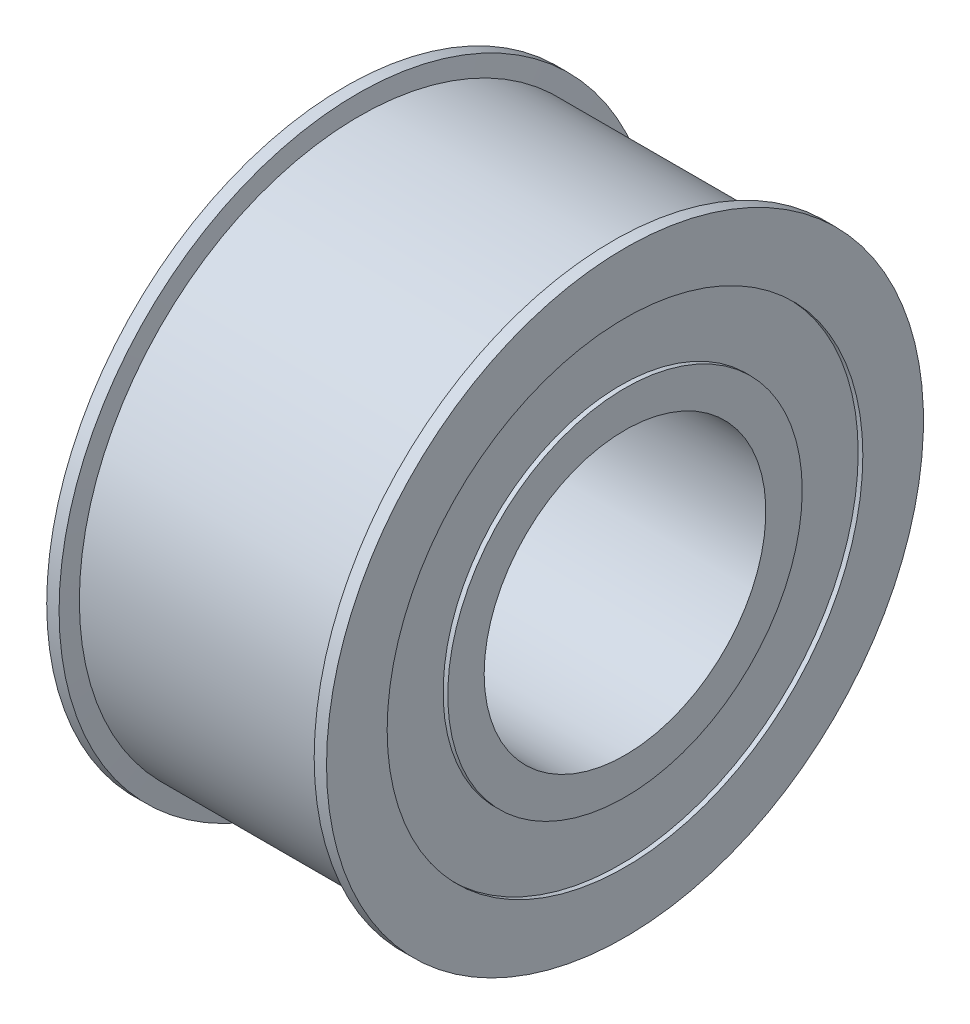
ISO-10303-21;
HEADER;
FILE_DESCRIPTION(('STEP AP214'),'2;1');
FILE_NAME('part.step','',(''),(''),'','','');
FILE_SCHEMA(('AUTOMOTIVE_DESIGN { 1 0 10303 214 1 1 1 1 }'));
ENDSEC;
DATA;
#1=APPLICATION_CONTEXT('core data for automotive mechanical design processes');
#2=APPLICATION_PROTOCOL_DEFINITION('international standard','automotive_design',2000,#1);
#3=PRODUCT_CONTEXT('',#1,'mechanical');
#4=PRODUCT('Part','Part','',(#3));
#5=PRODUCT_RELATED_PRODUCT_CATEGORY('part','',(#4));
#6=PRODUCT_DEFINITION_FORMATION('','',#4);
#7=PRODUCT_DEFINITION_CONTEXT('part definition',#1,'design');
#8=PRODUCT_DEFINITION('design','',#6,#7);
#9=PRODUCT_DEFINITION_SHAPE('','',#8);
#10=(LENGTH_UNIT() NAMED_UNIT(*) SI_UNIT(.MILLI.,.METRE.));
#11=(NAMED_UNIT(*) PLANE_ANGLE_UNIT() SI_UNIT($,.RADIAN.));
#12=(NAMED_UNIT(*) SI_UNIT($,.STERADIAN.) SOLID_ANGLE_UNIT());
#13=UNCERTAINTY_MEASURE_WITH_UNIT(LENGTH_MEASURE(1.E-05),#10,'distance_accuracy_value','');
#14=(GEOMETRIC_REPRESENTATION_CONTEXT(3) GLOBAL_UNCERTAINTY_ASSIGNED_CONTEXT((#13)) GLOBAL_UNIT_ASSIGNED_CONTEXT((#10,
#11,#12)) REPRESENTATION_CONTEXT('',''));
#15=CARTESIAN_POINT('',(0.,0.,0.));
#16=DIRECTION('',(0.,0.,1.));
#17=DIRECTION('',(1.,0.,0.));
#18=AXIS2_PLACEMENT_3D('',#15,#16,#17);
#19=CARTESIAN_POINT('',(-15.,15.1,0.));
#20=DIRECTION('',(1.,0.,0.));
#21=DIRECTION('',(0.,0.,-1.));
#22=AXIS2_PLACEMENT_3D('',#19,#20,#21);
#23=PLANE('',#22);
#24=CARTESIAN_POINT('',(-15.,0.,0.));
#25=DIRECTION('',(-1.,0.,0.));
#26=DIRECTION('',(0.,0.,1.));
#27=AXIS2_PLACEMENT_3D('',#24,#25,#26);
#28=CIRCLE('',#27,15.1);
#29=CARTESIAN_POINT('',(-15.,0.,15.1));
#30=VERTEX_POINT('',#29);
#31=EDGE_CURVE('E55',#30,#30,#28,.T.);
#32=ORIENTED_EDGE('',*,*,#31,.F.);
#33=EDGE_LOOP('',(#32));
#34=FACE_BOUND('',#33,.T.);
#35=CARTESIAN_POINT('',(-15.,0.,0.));
#36=DIRECTION('',(-1.,0.,0.));
#37=DIRECTION('',(0.,0.,1.));
#38=AXIS2_PLACEMENT_3D('',#35,#36,#37);
#39=CIRCLE('',#38,19.);
#40=CARTESIAN_POINT('',(-15.,0.,19.));
#41=VERTEX_POINT('',#40);
#42=EDGE_CURVE('E83',#41,#41,#39,.T.);
#43=ORIENTED_EDGE('',*,*,#42,.T.);
#44=EDGE_LOOP('',(#43));
#45=FACE_BOUND('',#44,.T.);
#46=ADVANCED_FACE('F32',(#34,#45),#23,.F.);
#47=CARTESIAN_POINT('',(15.,15.1,0.));
#48=DIRECTION('',(-1.,0.,0.));
#49=DIRECTION('',(0.,0.,1.));
#50=AXIS2_PLACEMENT_3D('',#47,#48,#49);
#51=PLANE('',#50);
#52=CARTESIAN_POINT('',(15.,0.,0.));
#53=DIRECTION('',(-1.,0.,0.));
#54=DIRECTION('',(0.,0.,1.));
#55=AXIS2_PLACEMENT_3D('',#52,#53,#54);
#56=CIRCLE('',#55,15.1);
#57=CARTESIAN_POINT('',(15.,0.,15.1));
#58=VERTEX_POINT('',#57);
#59=EDGE_CURVE('E52',#58,#58,#56,.T.);
#60=ORIENTED_EDGE('',*,*,#59,.T.);
#61=EDGE_LOOP('',(#60));
#62=FACE_BOUND('',#61,.T.);
#63=CARTESIAN_POINT('',(15.,0.,0.));
#64=DIRECTION('',(1.,0.,0.));
#65=DIRECTION('',(0.,0.,-1.));
#66=AXIS2_PLACEMENT_3D('',#63,#64,#65);
#67=CIRCLE('',#66,19.);
#68=CARTESIAN_POINT('',(15.,0.,-19.));
#69=VERTEX_POINT('',#68);
#70=EDGE_CURVE('E71',#69,#69,#67,.T.);
#71=ORIENTED_EDGE('',*,*,#70,.T.);
#72=EDGE_LOOP('',(#71));
#73=FACE_BOUND('',#72,.T.);
#74=ADVANCED_FACE('F121',(#62,#73),#51,.F.);
#75=CARTESIAN_POINT('',(-13.5,0.,0.));
#76=DIRECTION('',(-1.,0.,0.));
#77=DIRECTION('',(0.,0.,1.));
#78=AXIS2_PLACEMENT_3D('',#75,#76,#77);
#79=CONICAL_SURFACE('',#78,30.,1.48352986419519);
#80=CARTESIAN_POINT('',(-13.6749773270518,0.,0.));
#81=DIRECTION('',(-1.,0.,0.));
#82=DIRECTION('',(0.,0.,1.));
#83=AXIS2_PLACEMENT_3D('',#80,#81,#82);
#84=CIRCLE('',#83,32.);
#85=CARTESIAN_POINT('',(-13.6749773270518,0.,32.));
#86=VERTEX_POINT('',#85);
#87=EDGE_CURVE('E61',#86,#86,#84,.T.);
#88=ORIENTED_EDGE('',*,*,#87,.F.);
#89=EDGE_LOOP('',(#88));
#90=FACE_BOUND('',#89,.T.);
#91=CARTESIAN_POINT('',(-13.5,0.,0.));
#92=DIRECTION('',(-1.,0.,0.));
#93=DIRECTION('',(0.,0.,1.));
#94=AXIS2_PLACEMENT_3D('',#91,#92,#93);
#95=CIRCLE('',#94,30.);
#96=CARTESIAN_POINT('',(-13.5,0.,30.));
#97=VERTEX_POINT('',#96);
#98=EDGE_CURVE('E10',#97,#97,#95,.T.);
#99=ORIENTED_EDGE('',*,*,#98,.T.);
#100=EDGE_LOOP('',(#99));
#101=FACE_BOUND('',#100,.T.);
#102=ADVANCED_FACE('F34',(#90,#101),#79,.T.);
#103=CARTESIAN_POINT('',(0.,0.,0.));
#104=DIRECTION('',(-1.,0.,0.));
#105=DIRECTION('',(0.,0.,1.));
#106=AXIS2_PLACEMENT_3D('',#103,#104,#105);
#107=CYLINDRICAL_SURFACE('',#106,30.);
#108=ORIENTED_EDGE('',*,*,#98,.F.);
#109=EDGE_LOOP('',(#108));
#110=FACE_BOUND('',#109,.T.);
#111=CARTESIAN_POINT('',(13.5,0.,0.));
#112=DIRECTION('',(-1.,0.,0.));
#113=DIRECTION('',(0.,0.,1.));
#114=AXIS2_PLACEMENT_3D('',#111,#112,#113);
#115=CIRCLE('',#114,30.);
#116=CARTESIAN_POINT('',(13.5,0.,30.));
#117=VERTEX_POINT('',#116);
#118=EDGE_CURVE('E39',#117,#117,#115,.T.);
#119=ORIENTED_EDGE('',*,*,#118,.T.);
#120=EDGE_LOOP('',(#119));
#121=FACE_BOUND('',#120,.T.);
#122=ADVANCED_FACE('F120',(#110,#121),#107,.T.);
#123=CARTESIAN_POINT('',(13.6749773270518,0.,0.));
#124=DIRECTION('',(1.,0.,0.));
#125=DIRECTION('',(0.,0.,-1.));
#126=AXIS2_PLACEMENT_3D('',#123,#124,#125);
#127=CONICAL_SURFACE('',#126,32.,1.48352986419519);
#128=ORIENTED_EDGE('',*,*,#118,.F.);
#129=EDGE_LOOP('',(#128));
#130=FACE_BOUND('',#129,.T.);
#131=CARTESIAN_POINT('',(13.6749773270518,0.,0.));
#132=DIRECTION('',(-1.,0.,0.));
#133=DIRECTION('',(0.,0.,1.));
#134=AXIS2_PLACEMENT_3D('',#131,#132,#133);
#135=CIRCLE('',#134,32.);
#136=CARTESIAN_POINT('',(13.6749773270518,0.,32.));
#137=VERTEX_POINT('',#136);
#138=EDGE_CURVE('E43',#137,#137,#135,.T.);
#139=ORIENTED_EDGE('',*,*,#138,.T.);
#140=EDGE_LOOP('',(#139));
#141=FACE_BOUND('',#140,.T.);
#142=ADVANCED_FACE('F126',(#130,#141),#127,.T.);
#143=CARTESIAN_POINT('',(0.,0.,0.));
#144=DIRECTION('',(-1.,0.,0.));
#145=DIRECTION('',(0.,0.,1.));
#146=AXIS2_PLACEMENT_3D('',#143,#144,#145);
#147=CYLINDRICAL_SURFACE('',#146,32.);
#148=ORIENTED_EDGE('',*,*,#138,.F.);
#149=EDGE_LOOP('',(#148));
#150=FACE_BOUND('',#149,.T.);
#151=CARTESIAN_POINT('',(15.,0.,0.));
#152=DIRECTION('',(-1.,0.,0.));
#153=DIRECTION('',(0.,0.,1.));
#154=AXIS2_PLACEMENT_3D('',#151,#152,#153);
#155=CIRCLE('',#154,32.);
#156=CARTESIAN_POINT('',(15.,0.,32.));
#157=VERTEX_POINT('',#156);
#158=EDGE_CURVE('E47',#157,#157,#155,.T.);
#159=ORIENTED_EDGE('',*,*,#158,.T.);
#160=EDGE_LOOP('',(#159));
#161=FACE_BOUND('',#160,.T.);
#162=ADVANCED_FACE('F143',(#150,#161),#147,.T.);
#163=CARTESIAN_POINT('',(15.,0.,0.));
#164=DIRECTION('',(1.,0.,0.));
#165=DIRECTION('',(0.,0.,-1.));
#166=AXIS2_PLACEMENT_3D('',#163,#164,#165);
#167=CIRCLE('',#166,25.5);
#168=CARTESIAN_POINT('',(15.,0.,-25.5));
#169=VERTEX_POINT('',#168);
#170=EDGE_CURVE('E65',#169,#169,#167,.T.);
#171=ORIENTED_EDGE('',*,*,#170,.F.);
#172=EDGE_LOOP('',(#171));
#173=FACE_BOUND('',#172,.T.);
#174=ORIENTED_EDGE('',*,*,#158,.F.);
#175=EDGE_LOOP('',(#174));
#176=FACE_BOUND('',#175,.T.);
#177=ADVANCED_FACE('F130',(#173,#176),#51,.F.);
#178=CARTESIAN_POINT('',(0.,0.,0.));
#179=DIRECTION('',(-1.,0.,0.));
#180=DIRECTION('',(0.,0.,1.));
#181=AXIS2_PLACEMENT_3D('',#178,#179,#180);
#182=CYLINDRICAL_SURFACE('',#181,15.1);
#183=ORIENTED_EDGE('',*,*,#59,.F.);
#184=EDGE_LOOP('',(#183));
#185=FACE_BOUND('',#184,.T.);
#186=ORIENTED_EDGE('',*,*,#31,.T.);
#187=EDGE_LOOP('',(#186));
#188=FACE_BOUND('',#187,.T.);
#189=ADVANCED_FACE('F109',(#185,#188),#182,.F.);
#190=CARTESIAN_POINT('',(-15.,0.,0.));
#191=DIRECTION('',(-1.,0.,0.));
#192=DIRECTION('',(0.,0.,1.));
#193=AXIS2_PLACEMENT_3D('',#190,#191,#192);
#194=CIRCLE('',#193,25.5);
#195=CARTESIAN_POINT('',(-15.,0.,25.5));
#196=VERTEX_POINT('',#195);
#197=EDGE_CURVE('E77',#196,#196,#194,.T.);
#198=ORIENTED_EDGE('',*,*,#197,.F.);
#199=EDGE_LOOP('',(#198));
#200=FACE_BOUND('',#199,.T.);
#201=CARTESIAN_POINT('',(-15.,0.,0.));
#202=DIRECTION('',(-1.,0.,0.));
#203=DIRECTION('',(0.,0.,1.));
#204=AXIS2_PLACEMENT_3D('',#201,#202,#203);
#205=CIRCLE('',#204,32.);
#206=CARTESIAN_POINT('',(-15.,0.,32.));
#207=VERTEX_POINT('',#206);
#208=EDGE_CURVE('E58',#207,#207,#205,.T.);
#209=ORIENTED_EDGE('',*,*,#208,.T.);
#210=EDGE_LOOP('',(#209));
#211=FACE_BOUND('',#210,.T.);
#212=ADVANCED_FACE('F105',(#200,#211),#23,.F.);
#213=CARTESIAN_POINT('',(0.,0.,0.));
#214=DIRECTION('',(-1.,0.,0.));
#215=DIRECTION('',(0.,0.,1.));
#216=AXIS2_PLACEMENT_3D('',#213,#214,#215);
#217=CYLINDRICAL_SURFACE('',#216,32.);
#218=ORIENTED_EDGE('',*,*,#208,.F.);
#219=EDGE_LOOP('',(#218));
#220=FACE_BOUND('',#219,.T.);
#221=ORIENTED_EDGE('',*,*,#87,.T.);
#222=EDGE_LOOP('',(#221));
#223=FACE_BOUND('',#222,.T.);
#224=ADVANCED_FACE('F108',(#220,#223),#217,.T.);
#225=CARTESIAN_POINT('',(14.5,0.,0.));
#226=DIRECTION('',(1.,0.,0.));
#227=DIRECTION('',(0.,0.,-1.));
#228=AXIS2_PLACEMENT_3D('',#225,#226,#227);
#229=CYLINDRICAL_SURFACE('',#228,25.5);
#230=CARTESIAN_POINT('',(14.5,0.,0.));
#231=DIRECTION('',(1.,0.,0.));
#232=DIRECTION('',(0.,0.,-1.));
#233=AXIS2_PLACEMENT_3D('',#230,#231,#232);
#234=CIRCLE('',#233,25.5);
#235=CARTESIAN_POINT('',(14.5,0.,-25.5));
#236=VERTEX_POINT('',#235);
#237=EDGE_CURVE('E64',#236,#236,#234,.T.);
#238=ORIENTED_EDGE('',*,*,#237,.F.);
#239=EDGE_LOOP('',(#238));
#240=FACE_BOUND('',#239,.T.);
#241=ORIENTED_EDGE('',*,*,#170,.T.);
#242=EDGE_LOOP('',(#241));
#243=FACE_BOUND('',#242,.T.);
#244=ADVANCED_FACE('F115',(#240,#243),#229,.F.);
#245=CARTESIAN_POINT('',(14.5,0.,0.));
#246=DIRECTION('',(1.,0.,0.));
#247=DIRECTION('',(0.,0.,-1.));
#248=AXIS2_PLACEMENT_3D('',#245,#246,#247);
#249=PLANE('',#248);
#250=CARTESIAN_POINT('',(14.5,0.,0.));
#251=DIRECTION('',(1.,0.,0.));
#252=DIRECTION('',(0.,0.,-1.));
#253=AXIS2_PLACEMENT_3D('',#250,#251,#252);
#254=CIRCLE('',#253,19.);
#255=CARTESIAN_POINT('',(14.5,0.,-19.));
#256=VERTEX_POINT('',#255);
#257=EDGE_CURVE('E68',#256,#256,#254,.T.);
#258=ORIENTED_EDGE('',*,*,#257,.F.);
#259=EDGE_LOOP('',(#258));
#260=FACE_BOUND('',#259,.T.);
#261=ORIENTED_EDGE('',*,*,#237,.T.);
#262=EDGE_LOOP('',(#261));
#263=FACE_BOUND('',#262,.T.);
#264=ADVANCED_FACE('F187',(#260,#263),#249,.T.);
#265=CARTESIAN_POINT('',(14.5,0.,0.));
#266=DIRECTION('',(1.,0.,0.));
#267=DIRECTION('',(0.,0.,-1.));
#268=AXIS2_PLACEMENT_3D('',#265,#266,#267);
#269=CYLINDRICAL_SURFACE('',#268,19.);
#270=ORIENTED_EDGE('',*,*,#257,.T.);
#271=EDGE_LOOP('',(#270));
#272=FACE_BOUND('',#271,.T.);
#273=ORIENTED_EDGE('',*,*,#70,.F.);
#274=EDGE_LOOP('',(#273));
#275=FACE_BOUND('',#274,.T.);
#276=ADVANCED_FACE('F101',(#272,#275),#269,.T.);
#277=CARTESIAN_POINT('',(-14.5,0.,0.));
#278=DIRECTION('',(-1.,0.,0.));
#279=DIRECTION('',(0.,0.,1.));
#280=AXIS2_PLACEMENT_3D('',#277,#278,#279);
#281=CYLINDRICAL_SURFACE('',#280,25.5);
#282=CARTESIAN_POINT('',(-14.5,0.,0.));
#283=DIRECTION('',(-1.,0.,0.));
#284=DIRECTION('',(0.,0.,1.));
#285=AXIS2_PLACEMENT_3D('',#282,#283,#284);
#286=CIRCLE('',#285,25.5);
#287=CARTESIAN_POINT('',(-14.5,0.,25.5));
#288=VERTEX_POINT('',#287);
#289=EDGE_CURVE('E74',#288,#288,#286,.T.);
#290=ORIENTED_EDGE('',*,*,#289,.F.);
#291=EDGE_LOOP('',(#290));
#292=FACE_BOUND('',#291,.T.);
#293=ORIENTED_EDGE('',*,*,#197,.T.);
#294=EDGE_LOOP('',(#293));
#295=FACE_BOUND('',#294,.T.);
#296=ADVANCED_FACE('F95',(#292,#295),#281,.F.);
#297=CARTESIAN_POINT('',(-14.5,0.,0.));
#298=DIRECTION('',(-1.,0.,0.));
#299=DIRECTION('',(0.,0.,1.));
#300=AXIS2_PLACEMENT_3D('',#297,#298,#299);
#301=PLANE('',#300);
#302=CARTESIAN_POINT('',(-14.5,0.,0.));
#303=DIRECTION('',(-1.,0.,0.));
#304=DIRECTION('',(0.,0.,1.));
#305=AXIS2_PLACEMENT_3D('',#302,#303,#304);
#306=CIRCLE('',#305,19.);
#307=CARTESIAN_POINT('',(-14.5,0.,19.));
#308=VERTEX_POINT('',#307);
#309=EDGE_CURVE('E80',#308,#308,#306,.T.);
#310=ORIENTED_EDGE('',*,*,#309,.F.);
#311=EDGE_LOOP('',(#310));
#312=FACE_BOUND('',#311,.T.);
#313=ORIENTED_EDGE('',*,*,#289,.T.);
#314=EDGE_LOOP('',(#313));
#315=FACE_BOUND('',#314,.T.);
#316=ADVANCED_FACE('F92',(#312,#315),#301,.T.);
#317=CARTESIAN_POINT('',(-14.5,0.,0.));
#318=DIRECTION('',(-1.,0.,0.));
#319=DIRECTION('',(0.,0.,1.));
#320=AXIS2_PLACEMENT_3D('',#317,#318,#319);
#321=CYLINDRICAL_SURFACE('',#320,19.);
#322=ORIENTED_EDGE('',*,*,#309,.T.);
#323=EDGE_LOOP('',(#322));
#324=FACE_BOUND('',#323,.T.);
#325=ORIENTED_EDGE('',*,*,#42,.F.);
#326=EDGE_LOOP('',(#325));
#327=FACE_BOUND('',#326,.T.);
#328=ADVANCED_FACE('F89',(#324,#327),#321,.T.);
#329=CLOSED_SHELL('',(#46,#74,#102,#122,#142,#162,#177,#189,#212,#224,#244,#264,#276,#296,#316,#328));
#330=MANIFOLD_SOLID_BREP('B2',#329);
#331=ADVANCED_BREP_SHAPE_REPRESENTATION('',(#18,#330),#14);
#332=SHAPE_DEFINITION_REPRESENTATION(#9,#331);
ENDSEC;
END-ISO-10303-21;
